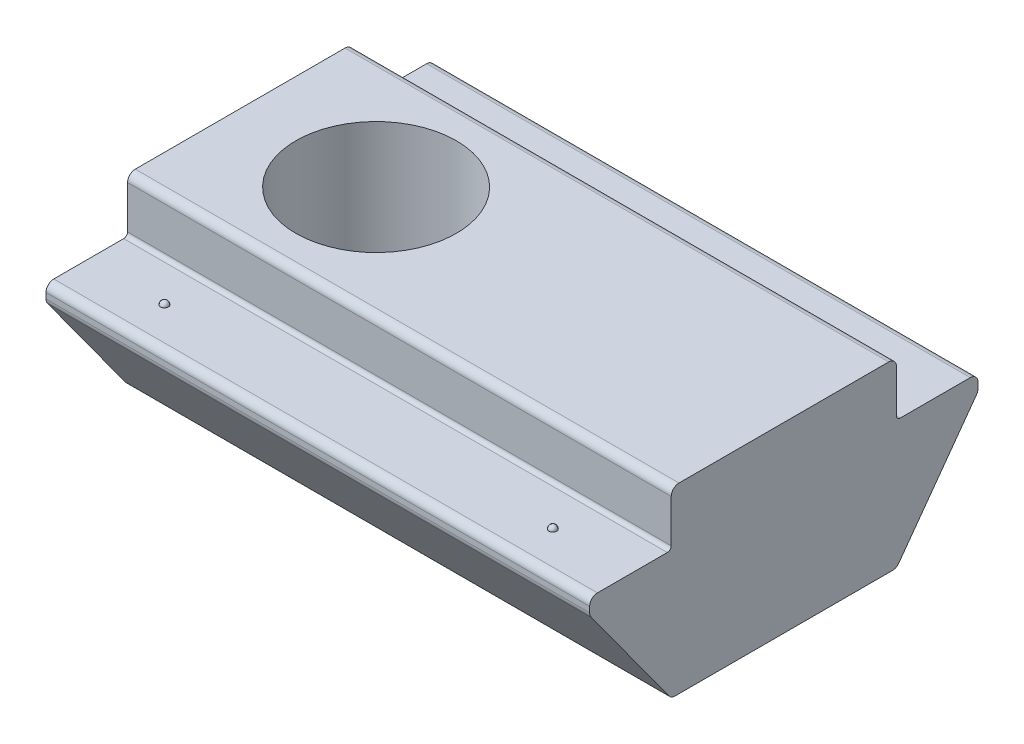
from build123d import *

# Parameters (mm, degrees)
BOSS_EXTRUDE1_DEPTH  = 14
FILLET1_R            = 0.1
FILLET2_R            = 0.2
SKETCH2_W            = 1.75
SKETCH2_H            = 1.05
LPATTERN1_COUNT      = 2
LPATTERN1_PITCH      = 7.9
LPATTERN1_COUNT_DIR2 = 2
LPATTERN1_PITCH_DIR2 = 10
TAP1_D               = 4.134


with BuildPart() as part:
    # Sketch1 → Boss-Extrude1 (new body)
    with BuildSketch(Plane(origin=(-3.5, 0, 0), x_dir=(0, 0, -1), z_dir=(1, 0, 0))):
        Polygon((2.9, -3.3), (-2.9, -3.3), (-5, -0.409597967), (-5, 0), (-2.9, 0), (-2.9, 1.4), (2.9, 1.4), (2.9, 0), (5, 0), (5, -0.409597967), align=None)
    extrude(amount=BOSS_EXTRUDE1_DEPTH)

    # Fillet1
    fillet1_edges = [part.edges().sort_by_distance(p)[0] for p in [
        (3.5, 0, -2.9),
        (3.5, 0, 2.9),
    ]]
    fillet(fillet1_edges, radius=FILLET1_R)

    # Fillet2
    fillet2_edges = [part.edges().sort_by_distance(p)[0] for p in [
        (3.5, 1.4, 2.9),
        (3.5, 1.4, -2.9),
        (3.5, 0, -5),
        (3.5, -0.409597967, -5),
        (3.5, -3.3, -2.9),
        (3.5, -3.3, 2.9),
        (3.5, -0.409597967, 5),
        (3.5, 0, 5),
    ]]
    fillet(fillet2_edges, radius=FILLET2_R)

    # Sketch2 → Cut-Revolve1 (revolve, cut)
    with BuildSketch(Plane(origin=(7, 0, 0), x_dir=(0, 0, -1), z_dir=(1, 0, 0)), mode=Mode.PRIVATE) as cut_revolve1_sk:
        with Locations((0.875, -2.775)):
            Rectangle(SKETCH2_W, SKETCH2_H)
    revolve(cut_revolve1_sk.sketch.rotate(Axis((7, 0, 0), (0, -1, 0)), 180), axis=Axis((7, 0, 0), (0, -1, 0)), mode=Mode.SUBTRACT)

    # Sketch3 → Revolve1 (revolve)
    with BuildSketch(Plane(origin=(7, 0, 0), x_dir=(0, 0, -1), z_dir=(1, 0, 0))):
        with BuildLine():
            Line((-1.75, -2.25), (0, -2.25))
            Line((0, -2.25), (0, -4))
            ThreePointArc((0, -4), (-1.237436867, -3.487436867), (-1.75, -2.25))
        make_face()
    revolve(axis=Axis((7, 0, 0), (0, -1, 0)))

    # Sketch4 → Revolve2 (revolve)
    with BuildSketch(Plane(origin=(-1.5, 0, 2.45), x_dir=(0, 0, -1), z_dir=(1, 0, 0)), mode=Mode.PRIVATE) as revolve2_sk:
        with BuildLine():
            Line((-1.6, 0), (-1.5, 0))
            Line((-1.5, 0), (-1.5, 0.1))
            ThreePointArc((-1.5, 0.1), (-1.570710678, 0.070710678), (-1.6, 0))
        make_face()
    revolve2 = revolve(revolve2_sk.sketch.rotate(Axis((-1.5, 0.1, 3.95), (0, -1, 0)), 180), axis=Axis((-1.5, 0.1, 3.95), (0, -1, 0)))

    # LPattern1: Revolve2 2 × 2
    with Locations(*[(j * LPATTERN1_PITCH_DIR2, 0, -i * LPATTERN1_PITCH) for i in range(LPATTERN1_COUNT) for j in range(LPATTERN1_COUNT_DIR2) if (i, j) != (0, 0)]):
        add(revolve2)

    # Tap1 (through all)
    with Locations(Plane(origin=(0, 1.4, 0), x_dir=(1, 0, 0), z_dir=(0, 1, 0))):
        with Locations((0, 0)):
            Hole(TAP1_D / 2)


solid = part.part
